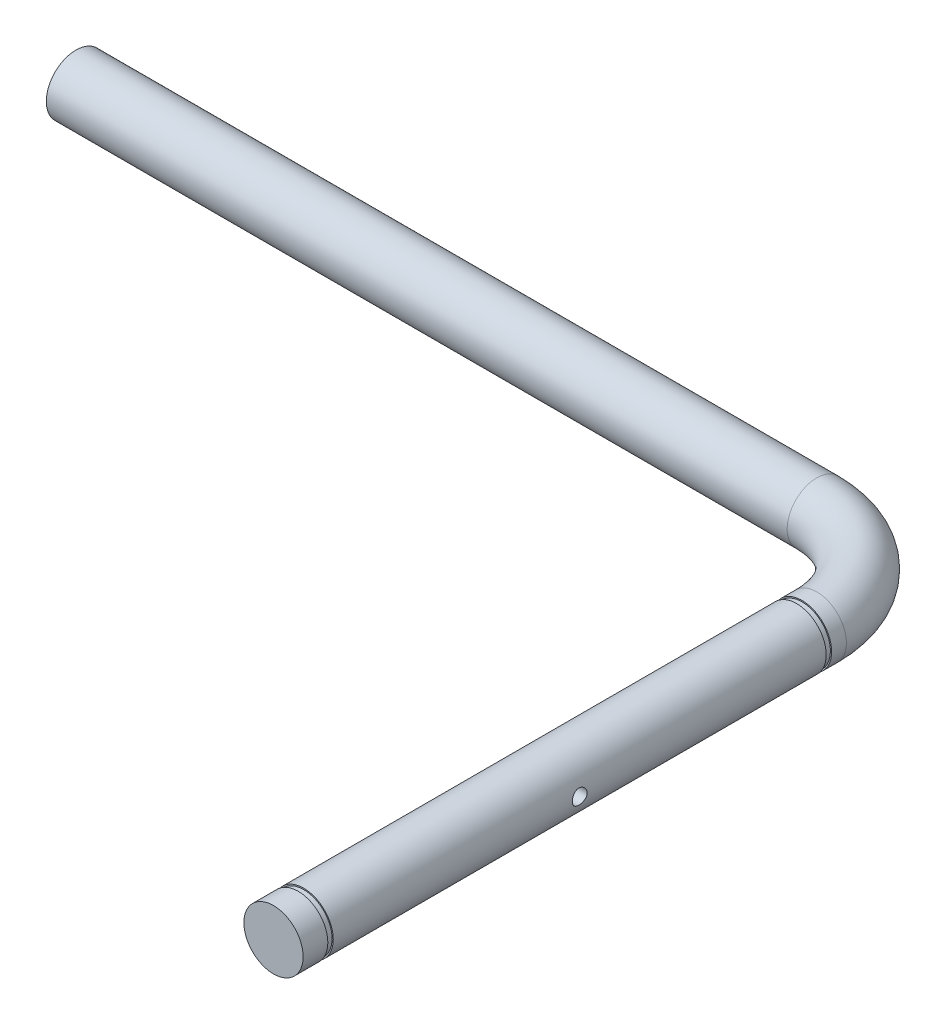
ISO-10303-21;
HEADER;
FILE_DESCRIPTION(('STEP AP214'),'2;1');
FILE_NAME('part.step','',(''),(''),'','','');
FILE_SCHEMA(('AUTOMOTIVE_DESIGN { 1 0 10303 214 1 1 1 1 }'));
ENDSEC;
DATA;
#1=APPLICATION_CONTEXT('core data for automotive mechanical design processes');
#2=APPLICATION_PROTOCOL_DEFINITION('international standard','automotive_design',2000,#1);
#3=PRODUCT_CONTEXT('',#1,'mechanical');
#4=PRODUCT('Part','Part','',(#3));
#5=PRODUCT_RELATED_PRODUCT_CATEGORY('part','',(#4));
#6=PRODUCT_DEFINITION_FORMATION('','',#4);
#7=PRODUCT_DEFINITION_CONTEXT('part definition',#1,'design');
#8=PRODUCT_DEFINITION('design','',#6,#7);
#9=PRODUCT_DEFINITION_SHAPE('','',#8);
#10=(LENGTH_UNIT() NAMED_UNIT(*) SI_UNIT(.MILLI.,.METRE.));
#11=(NAMED_UNIT(*) PLANE_ANGLE_UNIT() SI_UNIT($,.RADIAN.));
#12=(NAMED_UNIT(*) SI_UNIT($,.STERADIAN.) SOLID_ANGLE_UNIT());
#13=UNCERTAINTY_MEASURE_WITH_UNIT(LENGTH_MEASURE(1.E-05),#10,'distance_accuracy_value','');
#14=(GEOMETRIC_REPRESENTATION_CONTEXT(3) GLOBAL_UNCERTAINTY_ASSIGNED_CONTEXT((#13)) GLOBAL_UNIT_ASSIGNED_CONTEXT((#10,
#11,#12)) REPRESENTATION_CONTEXT('',''));
#15=CARTESIAN_POINT('',(0.,0.,0.));
#16=DIRECTION('',(0.,0.,1.));
#17=DIRECTION('',(1.,0.,0.));
#18=AXIS2_PLACEMENT_3D('',#15,#16,#17);
#19=CARTESIAN_POINT('',(0.,0.,-110.));
#20=DIRECTION('',(0.,0.,1.));
#21=DIRECTION('',(1.,0.,0.));
#22=AXIS2_PLACEMENT_3D('',#19,#20,#21);
#23=CYLINDRICAL_SURFACE('',#22,6.);
#24=CARTESIAN_POINT('',(-6.,0.,-57.5));
#25=CARTESIAN_POINT('',(-5.99999859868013,-0.0828760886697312,-57.4999976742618));
#26=CARTESIAN_POINT('',(-5.99826578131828,-0.165778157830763,-57.4931084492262));
#27=CARTESIAN_POINT('',(-5.99152113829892,-0.329206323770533,-57.465774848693));
#28=CARTESIAN_POINT('',(-5.98650745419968,-0.40973104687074,-57.4453227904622));
#29=CARTESIAN_POINT('',(-5.9737562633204,-0.566020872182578,-57.3915607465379));
#30=CARTESIAN_POINT('',(-5.96602202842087,-0.641791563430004,-57.3582662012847));
#31=CARTESIAN_POINT('',(-5.94865343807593,-0.786672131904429,-57.2798186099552));
#32=CARTESIAN_POINT('',(-5.9390190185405,-0.855781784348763,-57.2346651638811));
#33=CARTESIAN_POINT('',(-5.91867413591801,-0.986801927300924,-57.1327992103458));
#34=CARTESIAN_POINT('',(-5.90794707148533,-1.04855569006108,-57.0758884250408));
#35=CARTESIAN_POINT('',(-5.8867362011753,-1.16174892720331,-56.9525477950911));
#36=CARTESIAN_POINT('',(-5.87625242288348,-1.21318723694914,-56.8861168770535));
#37=CARTESIAN_POINT('',(-5.8565477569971,-1.30502654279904,-56.7444047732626));
#38=CARTESIAN_POINT('',(-5.84734794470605,-1.34525221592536,-56.6690067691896));
#39=CARTESIAN_POINT('',(-5.83149494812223,-1.41239690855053,-56.5122515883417));
#40=CARTESIAN_POINT('',(-5.82484135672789,-1.43931805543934,-56.4308953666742));
#41=CARTESIAN_POINT('',(-5.81500476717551,-1.47855483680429,-56.2662565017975));
#42=CARTESIAN_POINT('',(-5.81175491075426,-1.49115226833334,-56.1830451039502));
#43=CARTESIAN_POINT('',(-5.80889362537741,-1.50226177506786,-56.015631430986));
#44=CARTESIAN_POINT('',(-5.80928160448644,-1.50077614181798,-55.9314293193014));
#45=CARTESIAN_POINT('',(-5.81359205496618,-1.48398652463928,-55.7665841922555));
#46=CARTESIAN_POINT('',(-5.81742863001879,-1.46901834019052,-55.6859043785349));
#47=CARTESIAN_POINT('',(-5.82806709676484,-1.42622418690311,-55.5282389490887));
#48=CARTESIAN_POINT('',(-5.83486919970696,-1.39839730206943,-55.451253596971));
#49=CARTESIAN_POINT('',(-5.85075113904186,-1.33038947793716,-55.3022619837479));
#50=CARTESIAN_POINT('',(-5.85985327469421,-1.29008666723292,-55.2303138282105));
#51=CARTESIAN_POINT('',(-5.87929710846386,-1.19835627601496,-55.0940812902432));
#52=CARTESIAN_POINT('',(-5.88963902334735,-1.14692674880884,-55.0297982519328));
#53=CARTESIAN_POINT('',(-5.91075880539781,-1.03266342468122,-54.9087963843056));
#54=CARTESIAN_POINT('',(-5.92154069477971,-0.969546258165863,-54.8523455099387));
#55=CARTESIAN_POINT('',(-5.94205965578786,-0.834611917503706,-54.7507787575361));
#56=CARTESIAN_POINT('',(-5.95179669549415,-0.76279447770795,-54.7056632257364));
#57=CARTESIAN_POINT('',(-5.96917732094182,-0.612115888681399,-54.6279494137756));
#58=CARTESIAN_POINT('',(-5.97681360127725,-0.53323139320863,-54.5953946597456));
#59=CARTESIAN_POINT('',(-5.98907916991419,-0.370876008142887,-54.5440826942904));
#60=CARTESIAN_POINT('',(-5.99370903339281,-0.287405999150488,-54.5253228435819));
#61=CARTESIAN_POINT('',(-5.99935499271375,-0.120539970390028,-54.5025424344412));
#62=CARTESIAN_POINT('',(-6.00046053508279,-0.0371967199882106,-54.4981569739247));
#63=CARTESIAN_POINT('',(-5.99918804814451,0.129032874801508,-54.5032490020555));
#64=CARTESIAN_POINT('',(-5.99681033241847,0.211919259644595,-54.5127252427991));
#65=CARTESIAN_POINT('',(-5.98889581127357,0.373614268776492,-54.5449709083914));
#66=CARTESIAN_POINT('',(-5.98340634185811,0.452465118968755,-54.567541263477));
#67=CARTESIAN_POINT('',(-5.96988706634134,0.605257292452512,-54.6251070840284));
#68=CARTESIAN_POINT('',(-5.96185700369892,0.679198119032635,-54.6601038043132));
#69=CARTESIAN_POINT('',(-5.9439330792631,0.821523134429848,-54.7422361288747));
#70=CARTESIAN_POINT('',(-5.93400867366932,0.889785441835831,-54.7895761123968));
#71=CARTESIAN_POINT('',(-5.91344509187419,1.01752661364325,-54.894789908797));
#72=CARTESIAN_POINT('',(-5.90280579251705,1.07700395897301,-54.9526655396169));
#73=CARTESIAN_POINT('',(-5.88168956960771,1.18699056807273,-55.0790019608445));
#74=CARTESIAN_POINT('',(-5.87122304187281,1.23724386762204,-55.1476877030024));
#75=CARTESIAN_POINT('',(-5.85192878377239,1.3255107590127,-55.2927326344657));
#76=CARTESIAN_POINT('',(-5.84310098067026,1.36352489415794,-55.3690914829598));
#77=CARTESIAN_POINT('',(-5.82818094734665,1.4259514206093,-55.5269057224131));
#78=CARTESIAN_POINT('',(-5.82207255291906,1.45044439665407,-55.608327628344));
#79=CARTESIAN_POINT('',(-5.81326744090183,1.48534565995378,-55.7743096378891));
#80=CARTESIAN_POINT('',(-5.81056997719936,1.49575702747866,-55.8588690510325));
#81=CARTESIAN_POINT('',(-5.80894901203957,1.502038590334,-56.0261210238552));
#82=CARTESIAN_POINT('',(-5.80991932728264,1.49831789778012,-56.1087974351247));
#83=CARTESIAN_POINT('',(-5.81527909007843,1.47737727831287,-56.272303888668));
#84=CARTESIAN_POINT('',(-5.81966846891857,1.46015762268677,-56.3531339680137));
#85=CARTESIAN_POINT('',(-5.83131260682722,1.4129313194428,-56.5102084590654));
#86=CARTESIAN_POINT('',(-5.83855015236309,1.38300140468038,-56.5864773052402));
#87=CARTESIAN_POINT('',(-5.85507755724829,1.31126491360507,-56.7329653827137));
#88=CARTESIAN_POINT('',(-5.86436770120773,1.26945669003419,-56.8031837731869));
#89=CARTESIAN_POINT('',(-5.88425634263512,1.17386774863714,-56.937554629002));
#90=CARTESIAN_POINT('',(-5.89488264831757,1.11980316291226,-57.001501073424));
#91=CARTESIAN_POINT('',(-5.91608027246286,1.00178937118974,-57.1195470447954));
#92=CARTESIAN_POINT('',(-5.9266515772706,0.937837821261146,-57.173644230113));
#93=CARTESIAN_POINT('',(-5.94677655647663,0.800467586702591,-57.2714113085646));
#94=CARTESIAN_POINT('',(-5.95630833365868,0.726898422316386,-57.3148746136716));
#95=CARTESIAN_POINT('',(-5.97304924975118,0.573266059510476,-57.3887474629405));
#96=CARTESIAN_POINT('',(-5.98026005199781,0.493207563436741,-57.4191663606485));
#97=CARTESIAN_POINT('',(-5.99048059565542,0.344410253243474,-57.4615718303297));
#98=CARTESIAN_POINT('',(-5.99402585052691,0.27638017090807,-57.4759512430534));
#99=CARTESIAN_POINT('',(-5.99878605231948,0.138906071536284,-57.495165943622));
#100=CARTESIAN_POINT('',(-6.00000117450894,0.0694621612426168,-57.5000019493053));
#101=CARTESIAN_POINT('',(-6.,0.,-57.5));
#102=B_SPLINE_CURVE_WITH_KNOTS('',3,(#24,#25,#26,#27,#28,#29,#30,#31,#32,#33,#34,#35,#36,#37,
#38,#39,#40,#41,#42,#43,#44,#45,#46,#47,#48,#49,#50,#51,#52,#53,#54,#55,#56,#57,#58,#59,#60,#61,
#62,#63,#64,#65,#66,#67,#68,#69,#70,#71,#72,#73,#74,#75,#76,#77,#78,#79,#80,#81,#82,#83,#84,#85,
#86,#87,#88,#89,#90,#91,#92,#93,#94,#95,#96,#97,#98,#99,#100,#101),.UNSPECIFIED.,.T.,.F.,(4,2,2,
2,2,2,2,2,2,2,2,2,2,2,2,2,2,2,2,2,2,2,2,2,2,2,2,2,2,2,2,2,2,2,2,2,2,2,4),(0.,0.24837371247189,
0.496888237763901,0.745104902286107,0.99332994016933,1.24614435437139,1.49898729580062,
1.75558647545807,2.01214461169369,2.2635629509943,2.51494038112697,2.76022497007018,
3.00552703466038,3.25330527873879,3.50112690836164,3.7560150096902,4.01091089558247,
4.26668229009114,4.52240473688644,4.77158308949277,5.02073901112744,5.26620274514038,
5.51169127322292,5.76153587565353,6.0114236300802,6.26744509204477,6.5234551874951,
6.77792254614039,7.0323342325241,7.27943780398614,7.52653640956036,7.77216400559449,
8.01782568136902,8.26989576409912,8.5220256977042,8.7787218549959,9.03523363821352,
9.24342242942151,9.45159556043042),.UNSPECIFIED.);
#103=CARTESIAN_POINT('',(-6.,0.,-57.5));
#104=VERTEX_POINT('',#103);
#105=EDGE_CURVE('E29',#104,#104,#102,.T.);
#106=ORIENTED_EDGE('',*,*,#105,.F.);
#107=EDGE_LOOP('',(#106));
#108=FACE_BOUND('',#107,.T.);
#109=CARTESIAN_POINT('',(6.,0.,-57.5));
#110=CARTESIAN_POINT('',(5.99999859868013,0.0828760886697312,-57.4999976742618));
#111=CARTESIAN_POINT('',(5.99826578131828,0.165778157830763,-57.4931084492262));
#112=CARTESIAN_POINT('',(5.99152113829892,0.329206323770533,-57.465774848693));
#113=CARTESIAN_POINT('',(5.98650745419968,0.40973104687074,-57.4453227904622));
#114=CARTESIAN_POINT('',(5.9737562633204,0.566020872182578,-57.3915607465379));
#115=CARTESIAN_POINT('',(5.96602202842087,0.641791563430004,-57.3582662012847));
#116=CARTESIAN_POINT('',(5.94865343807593,0.786672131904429,-57.2798186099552));
#117=CARTESIAN_POINT('',(5.9390190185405,0.855781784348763,-57.2346651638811));
#118=CARTESIAN_POINT('',(5.91867413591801,0.986801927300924,-57.1327992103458));
#119=CARTESIAN_POINT('',(5.90794707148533,1.04855569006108,-57.0758884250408));
#120=CARTESIAN_POINT('',(5.8867362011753,1.16174892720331,-56.9525477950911));
#121=CARTESIAN_POINT('',(5.87625242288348,1.21318723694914,-56.8861168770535));
#122=CARTESIAN_POINT('',(5.8565477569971,1.30502654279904,-56.7444047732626));
#123=CARTESIAN_POINT('',(5.84734794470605,1.34525221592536,-56.6690067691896));
#124=CARTESIAN_POINT('',(5.83149494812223,1.41239690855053,-56.5122515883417));
#125=CARTESIAN_POINT('',(5.82484135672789,1.43931805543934,-56.4308953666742));
#126=CARTESIAN_POINT('',(5.81500476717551,1.47855483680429,-56.2662565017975));
#127=CARTESIAN_POINT('',(5.81175491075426,1.49115226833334,-56.1830451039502));
#128=CARTESIAN_POINT('',(5.80889362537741,1.50226177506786,-56.015631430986));
#129=CARTESIAN_POINT('',(5.80928160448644,1.50077614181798,-55.9314293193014));
#130=CARTESIAN_POINT('',(5.81359205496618,1.48398652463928,-55.7665841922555));
#131=CARTESIAN_POINT('',(5.81742863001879,1.46901834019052,-55.6859043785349));
#132=CARTESIAN_POINT('',(5.82806709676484,1.42622418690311,-55.5282389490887));
#133=CARTESIAN_POINT('',(5.83486919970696,1.39839730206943,-55.451253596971));
#134=CARTESIAN_POINT('',(5.85075113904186,1.33038947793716,-55.3022619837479));
#135=CARTESIAN_POINT('',(5.85985327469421,1.29008666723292,-55.2303138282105));
#136=CARTESIAN_POINT('',(5.87929710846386,1.19835627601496,-55.0940812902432));
#137=CARTESIAN_POINT('',(5.88963902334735,1.14692674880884,-55.0297982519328));
#138=CARTESIAN_POINT('',(5.91075880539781,1.03266342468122,-54.9087963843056));
#139=CARTESIAN_POINT('',(5.92154069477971,0.969546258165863,-54.8523455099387));
#140=CARTESIAN_POINT('',(5.94205965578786,0.834611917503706,-54.7507787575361));
#141=CARTESIAN_POINT('',(5.95179669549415,0.76279447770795,-54.7056632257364));
#142=CARTESIAN_POINT('',(5.96917732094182,0.612115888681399,-54.6279494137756));
#143=CARTESIAN_POINT('',(5.97681360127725,0.53323139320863,-54.5953946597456));
#144=CARTESIAN_POINT('',(5.98907916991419,0.370876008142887,-54.5440826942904));
#145=CARTESIAN_POINT('',(5.99370903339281,0.287405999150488,-54.5253228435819));
#146=CARTESIAN_POINT('',(5.99935499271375,0.120539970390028,-54.5025424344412));
#147=CARTESIAN_POINT('',(6.00046053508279,0.0371967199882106,-54.4981569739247));
#148=CARTESIAN_POINT('',(5.99918804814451,-0.129032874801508,-54.5032490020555));
#149=CARTESIAN_POINT('',(5.99681033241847,-0.211919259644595,-54.5127252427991));
#150=CARTESIAN_POINT('',(5.98889581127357,-0.373614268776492,-54.5449709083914));
#151=CARTESIAN_POINT('',(5.98340634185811,-0.452465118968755,-54.567541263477));
#152=CARTESIAN_POINT('',(5.96988706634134,-0.605257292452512,-54.6251070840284));
#153=CARTESIAN_POINT('',(5.96185700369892,-0.679198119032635,-54.6601038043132));
#154=CARTESIAN_POINT('',(5.9439330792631,-0.821523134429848,-54.7422361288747));
#155=CARTESIAN_POINT('',(5.93400867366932,-0.889785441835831,-54.7895761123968));
#156=CARTESIAN_POINT('',(5.91344509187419,-1.01752661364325,-54.894789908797));
#157=CARTESIAN_POINT('',(5.90280579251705,-1.07700395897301,-54.9526655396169));
#158=CARTESIAN_POINT('',(5.88168956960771,-1.18699056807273,-55.0790019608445));
#159=CARTESIAN_POINT('',(5.87122304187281,-1.23724386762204,-55.1476877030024));
#160=CARTESIAN_POINT('',(5.85192878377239,-1.3255107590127,-55.2927326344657));
#161=CARTESIAN_POINT('',(5.84310098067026,-1.36352489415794,-55.3690914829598));
#162=CARTESIAN_POINT('',(5.82818094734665,-1.4259514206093,-55.5269057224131));
#163=CARTESIAN_POINT('',(5.82207255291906,-1.45044439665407,-55.608327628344));
#164=CARTESIAN_POINT('',(5.81326744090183,-1.48534565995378,-55.7743096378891));
#165=CARTESIAN_POINT('',(5.81056997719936,-1.49575702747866,-55.8588690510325));
#166=CARTESIAN_POINT('',(5.80894901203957,-1.502038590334,-56.0261210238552));
#167=CARTESIAN_POINT('',(5.80991932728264,-1.49831789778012,-56.1087974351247));
#168=CARTESIAN_POINT('',(5.81527909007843,-1.47737727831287,-56.272303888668));
#169=CARTESIAN_POINT('',(5.81966846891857,-1.46015762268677,-56.3531339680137));
#170=CARTESIAN_POINT('',(5.83131260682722,-1.4129313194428,-56.5102084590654));
#171=CARTESIAN_POINT('',(5.83855015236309,-1.38300140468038,-56.5864773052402));
#172=CARTESIAN_POINT('',(5.85507755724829,-1.31126491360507,-56.7329653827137));
#173=CARTESIAN_POINT('',(5.86436770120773,-1.26945669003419,-56.8031837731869));
#174=CARTESIAN_POINT('',(5.88425634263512,-1.17386774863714,-56.937554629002));
#175=CARTESIAN_POINT('',(5.89488264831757,-1.11980316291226,-57.001501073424));
#176=CARTESIAN_POINT('',(5.91608027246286,-1.00178937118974,-57.1195470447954));
#177=CARTESIAN_POINT('',(5.9266515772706,-0.937837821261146,-57.173644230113));
#178=CARTESIAN_POINT('',(5.94677655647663,-0.800467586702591,-57.2714113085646));
#179=CARTESIAN_POINT('',(5.95630833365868,-0.726898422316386,-57.3148746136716));
#180=CARTESIAN_POINT('',(5.97304924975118,-0.573266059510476,-57.3887474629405));
#181=CARTESIAN_POINT('',(5.98026005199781,-0.493207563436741,-57.4191663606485));
#182=CARTESIAN_POINT('',(5.99048059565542,-0.344410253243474,-57.4615718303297));
#183=CARTESIAN_POINT('',(5.99402585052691,-0.27638017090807,-57.4759512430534));
#184=CARTESIAN_POINT('',(5.99878605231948,-0.138906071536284,-57.495165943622));
#185=CARTESIAN_POINT('',(6.00000117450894,-0.0694621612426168,-57.5000019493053));
#186=CARTESIAN_POINT('',(6.,0.,-57.5));
#187=B_SPLINE_CURVE_WITH_KNOTS('',3,(#109,#110,#111,#112,#113,#114,#115,#116,#117,#118,#119,
#120,#121,#122,#123,#124,#125,#126,#127,#128,#129,#130,#131,#132,#133,#134,#135,#136,#137,#138,
#139,#140,#141,#142,#143,#144,#145,#146,#147,#148,#149,#150,#151,#152,#153,#154,#155,#156,#157,
#158,#159,#160,#161,#162,#163,#164,#165,#166,#167,#168,#169,#170,#171,#172,#173,#174,#175,#176,
#177,#178,#179,#180,#181,#182,#183,#184,#185,#186),.UNSPECIFIED.,.T.,.F.,(4,2,2,2,2,2,2,2,2,2,2,
2,2,2,2,2,2,2,2,2,2,2,2,2,2,2,2,2,2,2,2,2,2,2,2,2,2,2,4),(0.,0.24837371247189,0.496888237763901,
0.745104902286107,0.99332994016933,1.24614435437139,1.49898729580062,1.75558647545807,
2.01214461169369,2.2635629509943,2.51494038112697,2.76022497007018,3.00552703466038,
3.25330527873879,3.50112690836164,3.7560150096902,4.01091089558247,4.26668229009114,
4.52240473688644,4.77158308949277,5.02073901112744,5.26620274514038,5.51169127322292,
5.76153587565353,6.0114236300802,6.26744509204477,6.5234551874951,6.77792254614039,
7.0323342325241,7.27943780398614,7.52653640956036,7.77216400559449,8.01782568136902,
8.26989576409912,8.5220256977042,8.7787218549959,9.03523363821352,9.24342242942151,
9.45159556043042),.UNSPECIFIED.);
#188=CARTESIAN_POINT('',(6.,0.,-57.5));
#189=VERTEX_POINT('',#188);
#190=EDGE_CURVE('E10',#189,#189,#187,.T.);
#191=ORIENTED_EDGE('',*,*,#190,.F.);
#192=EDGE_LOOP('',(#191));
#193=FACE_BOUND('',#192,.T.);
#194=CARTESIAN_POINT('',(0.,0.,-6.1));
#195=DIRECTION('',(0.,0.,1.));
#196=DIRECTION('',(1.,0.,0.));
#197=AXIS2_PLACEMENT_3D('',#194,#195,#196);
#198=CIRCLE('',#197,6.);
#199=CARTESIAN_POINT('',(6.,0.,-6.1));
#200=VERTEX_POINT('',#199);
#201=EDGE_CURVE('E112',#200,#200,#198,.T.);
#202=ORIENTED_EDGE('',*,*,#201,.F.);
#203=EDGE_LOOP('',(#202));
#204=FACE_BOUND('',#203,.T.);
#205=CARTESIAN_POINT('',(0.,0.,-105.9));
#206=DIRECTION('',(0.,0.,1.));
#207=DIRECTION('',(1.,0.,0.));
#208=AXIS2_PLACEMENT_3D('',#205,#206,#207);
#209=CIRCLE('',#208,6.);
#210=CARTESIAN_POINT('',(6.,0.,-105.9));
#211=VERTEX_POINT('',#210);
#212=EDGE_CURVE('E143',#211,#211,#209,.T.);
#213=ORIENTED_EDGE('',*,*,#212,.T.);
#214=EDGE_LOOP('',(#213));
#215=FACE_BOUND('',#214,.T.);
#216=ADVANCED_FACE('F25',(#108,#193,#204,#215),#23,.T.);
#217=CARTESIAN_POINT('',(0.,6.,-5.));
#218=DIRECTION('',(0.,0.,-1.));
#219=DIRECTION('',(-1.,0.,0.));
#220=AXIS2_PLACEMENT_3D('',#217,#218,#219);
#221=PLANE('',#220);
#222=CARTESIAN_POINT('',(0.,0.,-5.));
#223=DIRECTION('',(0.,0.,1.));
#224=DIRECTION('',(1.,0.,0.));
#225=AXIS2_PLACEMENT_3D('',#222,#223,#224);
#226=CIRCLE('',#225,5.75);
#227=CARTESIAN_POINT('',(5.75,0.,-5.));
#228=VERTEX_POINT('',#227);
#229=EDGE_CURVE('E125',#228,#228,#226,.T.);
#230=ORIENTED_EDGE('',*,*,#229,.T.);
#231=EDGE_LOOP('',(#230));
#232=FACE_BOUND('',#231,.T.);
#233=CARTESIAN_POINT('',(0.,0.,-5.));
#234=DIRECTION('',(0.,0.,1.));
#235=DIRECTION('',(1.,0.,0.));
#236=AXIS2_PLACEMENT_3D('',#233,#234,#235);
#237=CIRCLE('',#236,6.);
#238=CARTESIAN_POINT('',(6.,0.,-5.));
#239=VERTEX_POINT('',#238);
#240=EDGE_CURVE('E110',#239,#239,#237,.T.);
#241=ORIENTED_EDGE('',*,*,#240,.F.);
#242=EDGE_LOOP('',(#241));
#243=FACE_BOUND('',#242,.T.);
#244=ADVANCED_FACE('F76',(#232,#243),#221,.T.);
#245=CARTESIAN_POINT('',(0.,0.,0.));
#246=DIRECTION('',(0.,0.,1.));
#247=DIRECTION('',(1.,0.,0.));
#248=AXIS2_PLACEMENT_3D('',#245,#246,#247);
#249=CYLINDRICAL_SURFACE('',#248,5.75);
#250=CARTESIAN_POINT('',(0.,0.,-6.1));
#251=DIRECTION('',(0.,0.,1.));
#252=DIRECTION('',(1.,0.,0.));
#253=AXIS2_PLACEMENT_3D('',#250,#251,#252);
#254=CIRCLE('',#253,5.75);
#255=CARTESIAN_POINT('',(5.75,0.,-6.1));
#256=VERTEX_POINT('',#255);
#257=EDGE_CURVE('E116',#256,#256,#254,.T.);
#258=ORIENTED_EDGE('',*,*,#257,.T.);
#259=EDGE_LOOP('',(#258));
#260=FACE_BOUND('',#259,.T.);
#261=ORIENTED_EDGE('',*,*,#229,.F.);
#262=EDGE_LOOP('',(#261));
#263=FACE_BOUND('',#262,.T.);
#264=ADVANCED_FACE('F72',(#260,#263),#249,.T.);
#265=CARTESIAN_POINT('',(0.,6.,-6.1));
#266=DIRECTION('',(0.,0.,1.));
#267=DIRECTION('',(1.,0.,0.));
#268=AXIS2_PLACEMENT_3D('',#265,#266,#267);
#269=PLANE('',#268);
#270=ORIENTED_EDGE('',*,*,#201,.T.);
#271=EDGE_LOOP('',(#270));
#272=FACE_BOUND('',#271,.T.);
#273=ORIENTED_EDGE('',*,*,#257,.F.);
#274=EDGE_LOOP('',(#273));
#275=FACE_BOUND('',#274,.T.);
#276=ADVANCED_FACE('F68',(#272,#275),#269,.T.);
#277=CARTESIAN_POINT('',(0.,0.,0.));
#278=DIRECTION('',(0.,0.,1.));
#279=DIRECTION('',(1.,0.,0.));
#280=AXIS2_PLACEMENT_3D('',#277,#278,#279);
#281=PLANE('',#280);
#282=CARTESIAN_POINT('',(0.,0.,0.));
#283=DIRECTION('',(0.,0.,1.));
#284=DIRECTION('',(1.,0.,0.));
#285=AXIS2_PLACEMENT_3D('',#282,#283,#284);
#286=CIRCLE('',#285,6.);
#287=CARTESIAN_POINT('',(6.,0.,0.));
#288=VERTEX_POINT('',#287);
#289=EDGE_CURVE('E107',#288,#288,#286,.T.);
#290=ORIENTED_EDGE('',*,*,#289,.T.);
#291=EDGE_LOOP('',(#290));
#292=FACE_BOUND('',#291,.T.);
#293=ADVANCED_FACE('F71',(#292),#281,.T.);
#294=ORIENTED_EDGE('',*,*,#289,.F.);
#295=EDGE_LOOP('',(#294));
#296=FACE_BOUND('',#295,.T.);
#297=ORIENTED_EDGE('',*,*,#240,.T.);
#298=EDGE_LOOP('',(#297));
#299=FACE_BOUND('',#298,.T.);
#300=ADVANCED_FACE('F46',(#296,#299),#23,.T.);
#301=CARTESIAN_POINT('',(0.,6.,-105.9));
#302=DIRECTION('',(0.,0.,-1.));
#303=DIRECTION('',(-1.,0.,0.));
#304=AXIS2_PLACEMENT_3D('',#301,#302,#303);
#305=PLANE('',#304);
#306=CARTESIAN_POINT('',(0.,0.,-105.9));
#307=DIRECTION('',(0.,0.,1.));
#308=DIRECTION('',(1.,0.,0.));
#309=AXIS2_PLACEMENT_3D('',#306,#307,#308);
#310=CIRCLE('',#309,5.75);
#311=CARTESIAN_POINT('',(5.75,0.,-105.9));
#312=VERTEX_POINT('',#311);
#313=EDGE_CURVE('E113',#312,#312,#310,.T.);
#314=ORIENTED_EDGE('',*,*,#313,.T.);
#315=EDGE_LOOP('',(#314));
#316=FACE_BOUND('',#315,.T.);
#317=ORIENTED_EDGE('',*,*,#212,.F.);
#318=EDGE_LOOP('',(#317));
#319=FACE_BOUND('',#318,.T.);
#320=ADVANCED_FACE('F63',(#316,#319),#305,.T.);
#321=CARTESIAN_POINT('',(0.,0.,0.));
#322=DIRECTION('',(0.,0.,1.));
#323=DIRECTION('',(1.,0.,0.));
#324=AXIS2_PLACEMENT_3D('',#321,#322,#323);
#325=CYLINDRICAL_SURFACE('',#324,5.75);
#326=CARTESIAN_POINT('',(0.,0.,-107.));
#327=DIRECTION('',(0.,0.,1.));
#328=DIRECTION('',(1.,0.,0.));
#329=AXIS2_PLACEMENT_3D('',#326,#327,#328);
#330=CIRCLE('',#329,5.75);
#331=CARTESIAN_POINT('',(5.75,0.,-107.));
#332=VERTEX_POINT('',#331);
#333=EDGE_CURVE('E119',#332,#332,#330,.T.);
#334=ORIENTED_EDGE('',*,*,#333,.T.);
#335=EDGE_LOOP('',(#334));
#336=FACE_BOUND('',#335,.T.);
#337=ORIENTED_EDGE('',*,*,#313,.F.);
#338=EDGE_LOOP('',(#337));
#339=FACE_BOUND('',#338,.T.);
#340=ADVANCED_FACE('F59',(#336,#339),#325,.T.);
#341=CARTESIAN_POINT('',(0.,6.,-107.));
#342=DIRECTION('',(0.,0.,1.));
#343=DIRECTION('',(1.,0.,0.));
#344=AXIS2_PLACEMENT_3D('',#341,#342,#343);
#345=PLANE('',#344);
#346=CARTESIAN_POINT('',(0.,0.,-107.));
#347=DIRECTION('',(0.,0.,1.));
#348=DIRECTION('',(1.,0.,0.));
#349=AXIS2_PLACEMENT_3D('',#346,#347,#348);
#350=CIRCLE('',#349,6.);
#351=CARTESIAN_POINT('',(6.,0.,-107.));
#352=VERTEX_POINT('',#351);
#353=EDGE_CURVE('E142',#352,#352,#350,.T.);
#354=ORIENTED_EDGE('',*,*,#353,.T.);
#355=EDGE_LOOP('',(#354));
#356=FACE_BOUND('',#355,.T.);
#357=ORIENTED_EDGE('',*,*,#333,.F.);
#358=EDGE_LOOP('',(#357));
#359=FACE_BOUND('',#358,.T.);
#360=ADVANCED_FACE('F54',(#356,#359),#345,.T.);
#361=CARTESIAN_POINT('',(-170.,0.,-130.));
#362=DIRECTION('',(1.,0.,0.));
#363=DIRECTION('',(0.,0.,-1.));
#364=AXIS2_PLACEMENT_3D('',#361,#362,#363);
#365=PLANE('',#364);
#366=CARTESIAN_POINT('',(-170.,0.,-130.));
#367=DIRECTION('',(1.,0.,0.));
#368=DIRECTION('',(0.,0.,-1.));
#369=AXIS2_PLACEMENT_3D('',#366,#367,#368);
#370=CIRCLE('',#369,6.);
#371=CARTESIAN_POINT('',(-170.,0.,-136.));
#372=VERTEX_POINT('',#371);
#373=EDGE_CURVE('E37',#372,#372,#370,.T.);
#374=ORIENTED_EDGE('',*,*,#373,.F.);
#375=EDGE_LOOP('',(#374));
#376=FACE_BOUND('',#375,.T.);
#377=ADVANCED_FACE('F58',(#376),#365,.F.);
#378=CARTESIAN_POINT('',(-20.,0.,-130.));
#379=DIRECTION('',(-1.,0.,0.));
#380=DIRECTION('',(0.,0.,1.));
#381=AXIS2_PLACEMENT_3D('',#378,#379,#380);
#382=CYLINDRICAL_SURFACE('',#381,6.);
#383=CARTESIAN_POINT('',(-20.,0.,-130.));
#384=DIRECTION('',(1.,0.,0.));
#385=DIRECTION('',(0.,0.,-1.));
#386=AXIS2_PLACEMENT_3D('',#383,#384,#385);
#387=CIRCLE('',#386,6.);
#388=CARTESIAN_POINT('',(-20.,0.,-136.));
#389=VERTEX_POINT('',#388);
#390=EDGE_CURVE('E41',#389,#389,#387,.T.);
#391=ORIENTED_EDGE('',*,*,#390,.F.);
#392=EDGE_LOOP('',(#391));
#393=FACE_BOUND('',#392,.T.);
#394=ORIENTED_EDGE('',*,*,#373,.T.);
#395=EDGE_LOOP('',(#394));
#396=FACE_BOUND('',#395,.T.);
#397=ADVANCED_FACE('F27',(#393,#396),#382,.T.);
#398=CARTESIAN_POINT('',(-20.,0.,-110.));
#399=DIRECTION('',(0.,1.,0.));
#400=DIRECTION('',(0.,0.,1.));
#401=AXIS2_PLACEMENT_3D('',#398,#399,#400);
#402=TOROIDAL_SURFACE('',#401,20.,6.);
#403=CARTESIAN_POINT('',(0.,0.,-110.));
#404=DIRECTION('',(0.,0.,1.));
#405=DIRECTION('',(1.,0.,0.));
#406=AXIS2_PLACEMENT_3D('',#403,#404,#405);
#407=CIRCLE('',#406,6.);
#408=CARTESIAN_POINT('',(6.,0.,-110.));
#409=VERTEX_POINT('',#408);
#410=EDGE_CURVE('E129',#409,#409,#407,.T.);
#411=CARTESIAN_POINT('',(-20.,0.,-110.));
#412=DIRECTION('',(0.,1.,0.));
#413=DIRECTION('',(0.,0.,1.));
#414=AXIS2_PLACEMENT_3D('',#411,#412,#413);
#415=CIRCLE('',#414,26.);
#416=EDGE_CURVE('',#409,#389,#415,.T.);
#417=ORIENTED_EDGE('',*,*,#410,.F.);
#418=ORIENTED_EDGE('',*,*,#390,.T.);
#419=ORIENTED_EDGE('',*,*,#416,.T.);
#420=ORIENTED_EDGE('',*,*,#416,.F.);
#421=EDGE_LOOP('',(#417,#419,#418,#420));
#422=FACE_BOUND('',#421,.T.);
#423=ADVANCED_FACE('F89',(#422),#402,.T.);
#424=ORIENTED_EDGE('',*,*,#410,.T.);
#425=EDGE_LOOP('',(#424));
#426=FACE_BOUND('',#425,.T.);
#427=ORIENTED_EDGE('',*,*,#353,.F.);
#428=EDGE_LOOP('',(#427));
#429=FACE_BOUND('',#428,.T.);
#430=ADVANCED_FACE('F53',(#426,#429),#23,.T.);
#431=CARTESIAN_POINT('',(-170.,0.,-56.));
#432=DIRECTION('',(1.,0.,0.));
#433=DIRECTION('',(0.,0.,-1.));
#434=AXIS2_PLACEMENT_3D('',#431,#432,#433);
#435=CYLINDRICAL_SURFACE('',#434,1.5);
#436=ORIENTED_EDGE('',*,*,#190,.T.);
#437=EDGE_LOOP('',(#436));
#438=FACE_BOUND('',#437,.T.);
#439=ORIENTED_EDGE('',*,*,#105,.T.);
#440=EDGE_LOOP('',(#439));
#441=FACE_BOUND('',#440,.T.);
#442=ADVANCED_FACE('F49',(#438,#441),#435,.F.);
#443=CLOSED_SHELL('',(#216,#244,#264,#276,#293,#300,#320,#340,#360,#377,#397,#423,#430,#442));
#444=MANIFOLD_SOLID_BREP('B2',#443);
#445=ADVANCED_BREP_SHAPE_REPRESENTATION('',(#18,#444),#14);
#446=SHAPE_DEFINITION_REPRESENTATION(#9,#445);
ENDSEC;
END-ISO-10303-21;
